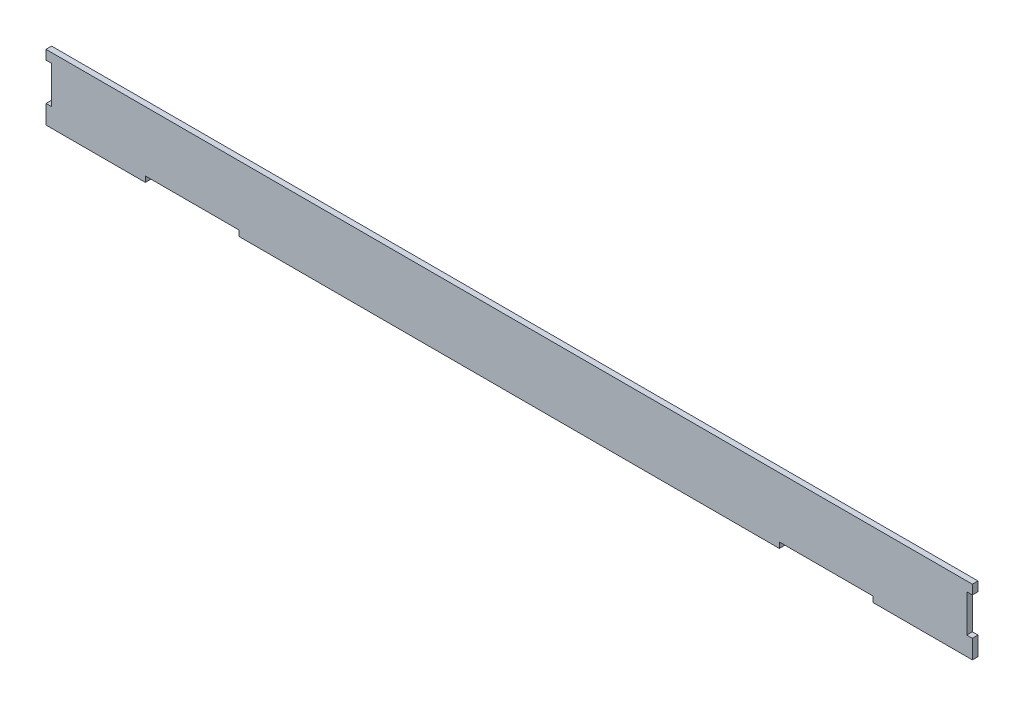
from build123d import *

# Parameters (mm, degrees)
BOSS_EXTRUDE1_DEPTH = 3


with BuildPart() as part:
    # Sketch2 → Boss-Extrude1 (new body)
    with BuildSketch(Plane.XY):
        Polygon((103, 0), (391.4, 0), (391.4, 3), (441.4, 3), (441.4, 0), (494.4, 0), (494.4, 10), (491.4, 10), (491.4, 30), (494.4, 30), (494.4, 35), (0, 35), (0, 30), (3, 30), (3, 10), (0, 10), (0, 0), (53, 0), (53, 3), (103, 3), align=None)
    extrude(amount=BOSS_EXTRUDE1_DEPTH)


solid = part.part
